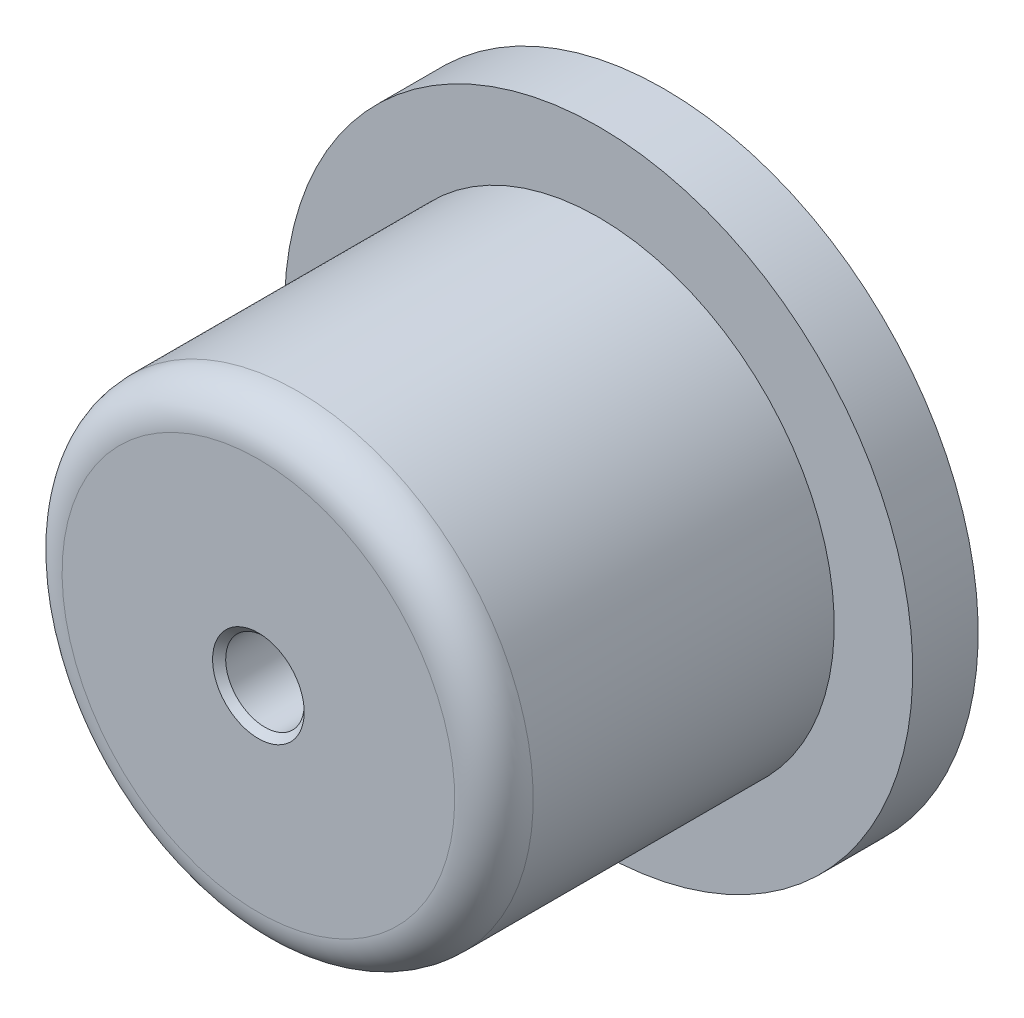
ISO-10303-21;
HEADER;
FILE_DESCRIPTION(('STEP AP214'),'2;1');
FILE_NAME('part.step','',(''),(''),'','','');
FILE_SCHEMA(('AUTOMOTIVE_DESIGN { 1 0 10303 214 1 1 1 1 }'));
ENDSEC;
DATA;
#1=APPLICATION_CONTEXT('core data for automotive mechanical design processes');
#2=APPLICATION_PROTOCOL_DEFINITION('international standard','automotive_design',2000,#1);
#3=PRODUCT_CONTEXT('',#1,'mechanical');
#4=PRODUCT('Part','Part','',(#3));
#5=PRODUCT_RELATED_PRODUCT_CATEGORY('part','',(#4));
#6=PRODUCT_DEFINITION_FORMATION('','',#4);
#7=PRODUCT_DEFINITION_CONTEXT('part definition',#1,'design');
#8=PRODUCT_DEFINITION('design','',#6,#7);
#9=PRODUCT_DEFINITION_SHAPE('','',#8);
#10=(LENGTH_UNIT() NAMED_UNIT(*) SI_UNIT(.MILLI.,.METRE.));
#11=(NAMED_UNIT(*) PLANE_ANGLE_UNIT() SI_UNIT($,.RADIAN.));
#12=(NAMED_UNIT(*) SI_UNIT($,.STERADIAN.) SOLID_ANGLE_UNIT());
#13=UNCERTAINTY_MEASURE_WITH_UNIT(LENGTH_MEASURE(1.E-05),#10,'distance_accuracy_value','');
#14=(GEOMETRIC_REPRESENTATION_CONTEXT(3) GLOBAL_UNCERTAINTY_ASSIGNED_CONTEXT((#13)) GLOBAL_UNIT_ASSIGNED_CONTEXT((#10,
#11,#12)) REPRESENTATION_CONTEXT('',''));
#15=CARTESIAN_POINT('',(0.,0.,0.));
#16=DIRECTION('',(0.,0.,1.));
#17=DIRECTION('',(1.,0.,0.));
#18=AXIS2_PLACEMENT_3D('',#15,#16,#17);
#19=CARTESIAN_POINT('',(0.,0.,0.));
#20=DIRECTION('',(0.,0.,-1.));
#21=DIRECTION('',(0.,1.,0.));
#22=AXIS2_PLACEMENT_3D('',#19,#20,#21);
#23=PLANE('',#22);
#24=CARTESIAN_POINT('',(0.,0.,0.));
#25=DIRECTION('',(0.,0.,-1.));
#26=DIRECTION('',(0.,1.,0.));
#27=AXIS2_PLACEMENT_3D('',#24,#25,#26);
#28=CIRCLE('',#27,24.);
#29=CARTESIAN_POINT('',(0.,24.,0.));
#30=VERTEX_POINT('',#29);
#31=EDGE_CURVE('E11',#30,#30,#28,.T.);
#32=ORIENTED_EDGE('',*,*,#31,.T.);
#33=EDGE_LOOP('',(#32));
#34=FACE_BOUND('',#33,.T.);
#35=ADVANCED_FACE('F38',(#34),#23,.T.);
#36=CARTESIAN_POINT('',(0.,0.,0.));
#37=DIRECTION('',(0.,0.,-1.));
#38=DIRECTION('',(0.,1.,0.));
#39=AXIS2_PLACEMENT_3D('',#36,#37,#38);
#40=CYLINDRICAL_SURFACE('',#39,24.);
#41=CARTESIAN_POINT('',(0.,0.,5.));
#42=DIRECTION('',(0.,0.,-1.));
#43=DIRECTION('',(0.,1.,0.));
#44=AXIS2_PLACEMENT_3D('',#41,#42,#43);
#45=CIRCLE('',#44,24.);
#46=CARTESIAN_POINT('',(0.,24.,5.));
#47=VERTEX_POINT('',#46);
#48=EDGE_CURVE('E45',#47,#47,#45,.T.);
#49=ORIENTED_EDGE('',*,*,#48,.T.);
#50=EDGE_LOOP('',(#49));
#51=FACE_BOUND('',#50,.T.);
#52=ORIENTED_EDGE('',*,*,#31,.F.);
#53=EDGE_LOOP('',(#52));
#54=FACE_BOUND('',#53,.T.);
#55=ADVANCED_FACE('F83',(#51,#54),#40,.T.);
#56=CARTESIAN_POINT('',(0.,24.,5.));
#57=DIRECTION('',(0.,0.,1.));
#58=DIRECTION('',(0.,-1.,0.));
#59=AXIS2_PLACEMENT_3D('',#56,#57,#58);
#60=PLANE('',#59);
#61=CARTESIAN_POINT('',(0.,0.,5.));
#62=DIRECTION('',(0.,0.,-1.));
#63=DIRECTION('',(0.,1.,0.));
#64=AXIS2_PLACEMENT_3D('',#61,#62,#63);
#65=CIRCLE('',#64,18.);
#66=CARTESIAN_POINT('',(0.,18.,5.));
#67=VERTEX_POINT('',#66);
#68=EDGE_CURVE('E76',#67,#67,#65,.T.);
#69=ORIENTED_EDGE('',*,*,#68,.T.);
#70=EDGE_LOOP('',(#69));
#71=FACE_BOUND('',#70,.T.);
#72=ORIENTED_EDGE('',*,*,#48,.F.);
#73=EDGE_LOOP('',(#72));
#74=FACE_BOUND('',#73,.T.);
#75=ADVANCED_FACE('F86',(#71,#74),#60,.T.);
#76=CARTESIAN_POINT('',(0.,0.,0.));
#77=DIRECTION('',(0.,0.,-1.));
#78=DIRECTION('',(0.,1.,0.));
#79=AXIS2_PLACEMENT_3D('',#76,#77,#78);
#80=CYLINDRICAL_SURFACE('',#79,18.);
#81=CARTESIAN_POINT('',(0.,0.,28.));
#82=DIRECTION('',(0.,0.,-1.));
#83=DIRECTION('',(0.,1.,0.));
#84=AXIS2_PLACEMENT_3D('',#81,#82,#83);
#85=CIRCLE('',#84,18.);
#86=CARTESIAN_POINT('',(0.,18.,28.));
#87=VERTEX_POINT('',#86);
#88=EDGE_CURVE('E72',#87,#87,#85,.T.);
#89=ORIENTED_EDGE('',*,*,#88,.T.);
#90=EDGE_LOOP('',(#89));
#91=FACE_BOUND('',#90,.T.);
#92=ORIENTED_EDGE('',*,*,#68,.F.);
#93=EDGE_LOOP('',(#92));
#94=FACE_BOUND('',#93,.T.);
#95=ADVANCED_FACE('F88',(#91,#94),#80,.T.);
#96=CARTESIAN_POINT('',(0.,0.,28.));
#97=DIRECTION('',(0.,0.,-1.));
#98=DIRECTION('',(0.,1.,0.));
#99=AXIS2_PLACEMENT_3D('',#96,#97,#98);
#100=TOROIDAL_SURFACE('',#99,15.,3.);
#101=CARTESIAN_POINT('',(0.,0.,31.));
#102=DIRECTION('',(0.,0.,-1.));
#103=DIRECTION('',(0.,1.,0.));
#104=AXIS2_PLACEMENT_3D('',#101,#102,#103);
#105=CIRCLE('',#104,15.);
#106=CARTESIAN_POINT('',(0.,15.,31.));
#107=VERTEX_POINT('',#106);
#108=EDGE_CURVE('E68',#107,#107,#105,.T.);
#109=ORIENTED_EDGE('',*,*,#108,.T.);
#110=EDGE_LOOP('',(#109));
#111=FACE_BOUND('',#110,.T.);
#112=ORIENTED_EDGE('',*,*,#88,.F.);
#113=EDGE_LOOP('',(#112));
#114=FACE_BOUND('',#113,.T.);
#115=ADVANCED_FACE('F95',(#111,#114),#100,.T.);
#116=CARTESIAN_POINT('',(0.,15.,31.));
#117=DIRECTION('',(0.,0.,1.));
#118=DIRECTION('',(0.,-1.,0.));
#119=AXIS2_PLACEMENT_3D('',#116,#117,#118);
#120=PLANE('',#119);
#121=CARTESIAN_POINT('',(0.,0.,31.));
#122=DIRECTION('',(0.,0.,-1.));
#123=DIRECTION('',(0.,1.,0.));
#124=AXIS2_PLACEMENT_3D('',#121,#122,#123);
#125=CIRCLE('',#124,3.49999999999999);
#126=CARTESIAN_POINT('',(0.,3.49999999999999,31.));
#127=VERTEX_POINT('',#126);
#128=EDGE_CURVE('E63',#127,#127,#125,.T.);
#129=ORIENTED_EDGE('',*,*,#128,.T.);
#130=EDGE_LOOP('',(#129));
#131=FACE_BOUND('',#130,.T.);
#132=ORIENTED_EDGE('',*,*,#108,.F.);
#133=EDGE_LOOP('',(#132));
#134=FACE_BOUND('',#133,.T.);
#135=ADVANCED_FACE('F121',(#131,#134),#120,.T.);
#136=CARTESIAN_POINT('',(0.,0.,31.));
#137=DIRECTION('',(0.,0.,1.));
#138=DIRECTION('',(0.,-1.,0.));
#139=AXIS2_PLACEMENT_3D('',#136,#137,#138);
#140=CONICAL_SURFACE('',#139,3.49999999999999,0.785398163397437);
#141=CARTESIAN_POINT('',(0.,0.,30.5));
#142=DIRECTION('',(0.,0.,-1.));
#143=DIRECTION('',(0.,1.,0.));
#144=AXIS2_PLACEMENT_3D('',#141,#142,#143);
#145=CIRCLE('',#144,3.);
#146=CARTESIAN_POINT('',(0.,3.,30.5));
#147=VERTEX_POINT('',#146);
#148=EDGE_CURVE('E58',#147,#147,#145,.T.);
#149=ORIENTED_EDGE('',*,*,#148,.T.);
#150=EDGE_LOOP('',(#149));
#151=FACE_BOUND('',#150,.T.);
#152=ORIENTED_EDGE('',*,*,#128,.F.);
#153=EDGE_LOOP('',(#152));
#154=FACE_BOUND('',#153,.T.);
#155=ADVANCED_FACE('F130',(#151,#154),#140,.F.);
#156=CARTESIAN_POINT('',(0.,0.,0.));
#157=DIRECTION('',(0.,0.,-1.));
#158=DIRECTION('',(0.,1.,0.));
#159=AXIS2_PLACEMENT_3D('',#156,#157,#158);
#160=CYLINDRICAL_SURFACE('',#159,3.);
#161=CARTESIAN_POINT('',(0.,0.,22.));
#162=DIRECTION('',(0.,0.,-1.));
#163=DIRECTION('',(0.,1.,0.));
#164=AXIS2_PLACEMENT_3D('',#161,#162,#163);
#165=CIRCLE('',#164,3.);
#166=CARTESIAN_POINT('',(0.,3.,22.));
#167=VERTEX_POINT('',#166);
#168=EDGE_CURVE('E55',#167,#167,#165,.T.);
#169=ORIENTED_EDGE('',*,*,#168,.T.);
#170=EDGE_LOOP('',(#169));
#171=FACE_BOUND('',#170,.T.);
#172=ORIENTED_EDGE('',*,*,#148,.F.);
#173=EDGE_LOOP('',(#172));
#174=FACE_BOUND('',#173,.T.);
#175=ADVANCED_FACE('F51',(#171,#174),#160,.F.);
#176=CARTESIAN_POINT('',(0.,0.,22.));
#177=DIRECTION('',(0.,0.,1.));
#178=DIRECTION('',(0.,-1.,0.));
#179=AXIS2_PLACEMENT_3D('',#176,#177,#178);
#180=CONICAL_SURFACE('',#179,3.,1.04719755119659);
#181=CARTESIAN_POINT('',(0.,0.,20.2679491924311));
#182=VERTEX_POINT('',#181);
#183=VERTEX_LOOP('',#182);
#184=FACE_BOUND('',#183,.T.);
#185=ORIENTED_EDGE('',*,*,#168,.F.);
#186=EDGE_LOOP('',(#185));
#187=FACE_BOUND('',#186,.T.);
#188=ADVANCED_FACE('F48',(#184,#187),#180,.F.);
#189=CLOSED_SHELL('',(#35,#55,#75,#95,#115,#135,#155,#175,#188));
#190=MANIFOLD_SOLID_BREP('B2',#189);
#191=ADVANCED_BREP_SHAPE_REPRESENTATION('',(#18,#190),#14);
#192=SHAPE_DEFINITION_REPRESENTATION(#9,#191);
ENDSEC;
END-ISO-10303-21;
